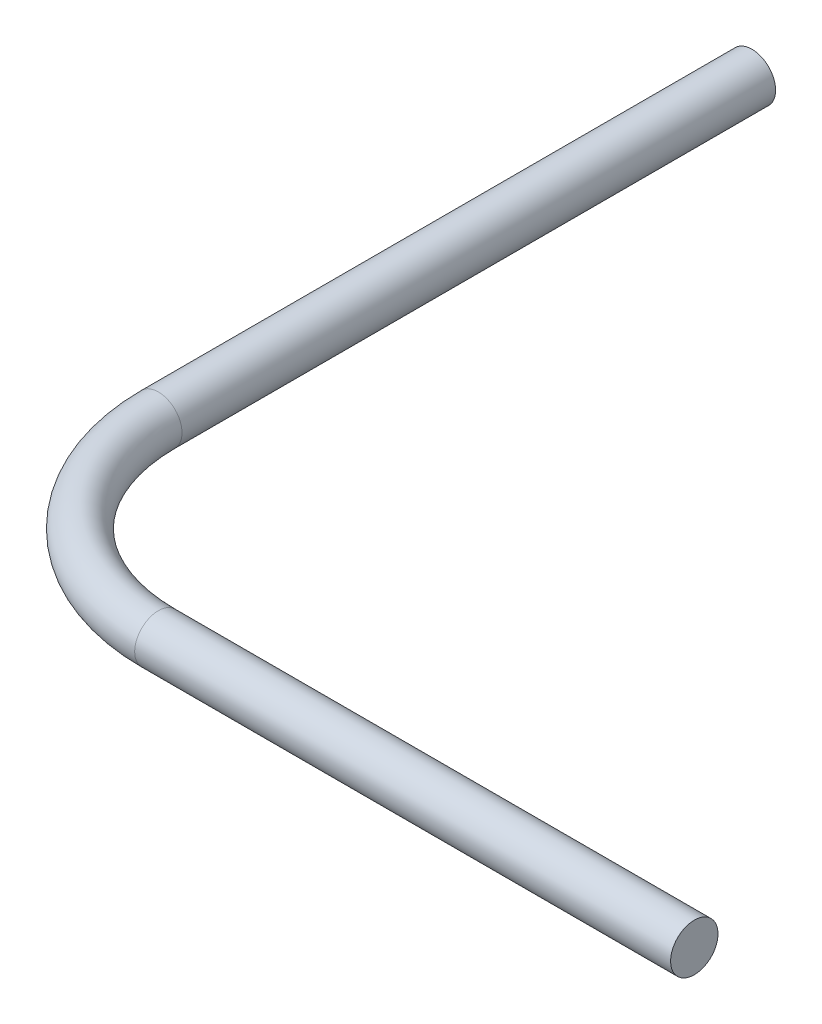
from build123d import *

# Parameters (mm, degrees)
ESQUISSE1_R = 0.25


with BuildPart() as part:
    # Balayage1: sweep along a path in Esquisse2
    with BuildLine(Plane(origin=(0, -8.25, 0), x_dir=(-1, 0, 0), z_dir=(0, 1, 0))) as balayage1_path:
        Line((6.25, 0), (6.25, 6.265831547))
        ThreePointArc((6.25, 6.265831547), (5.664213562, 7.68004511), (4.25, 8.265831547))
        Line((4.25, 8.265831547), (-1.407342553, 8.265831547))
    # Esquisse1 → Balayage1 (sweep)
    with BuildSketch(Plane.XY):
        with Locations((-6.25, -8.25)):
            Circle(ESQUISSE1_R)
    sweep(path=balayage1_path.line)


solid = part.part
